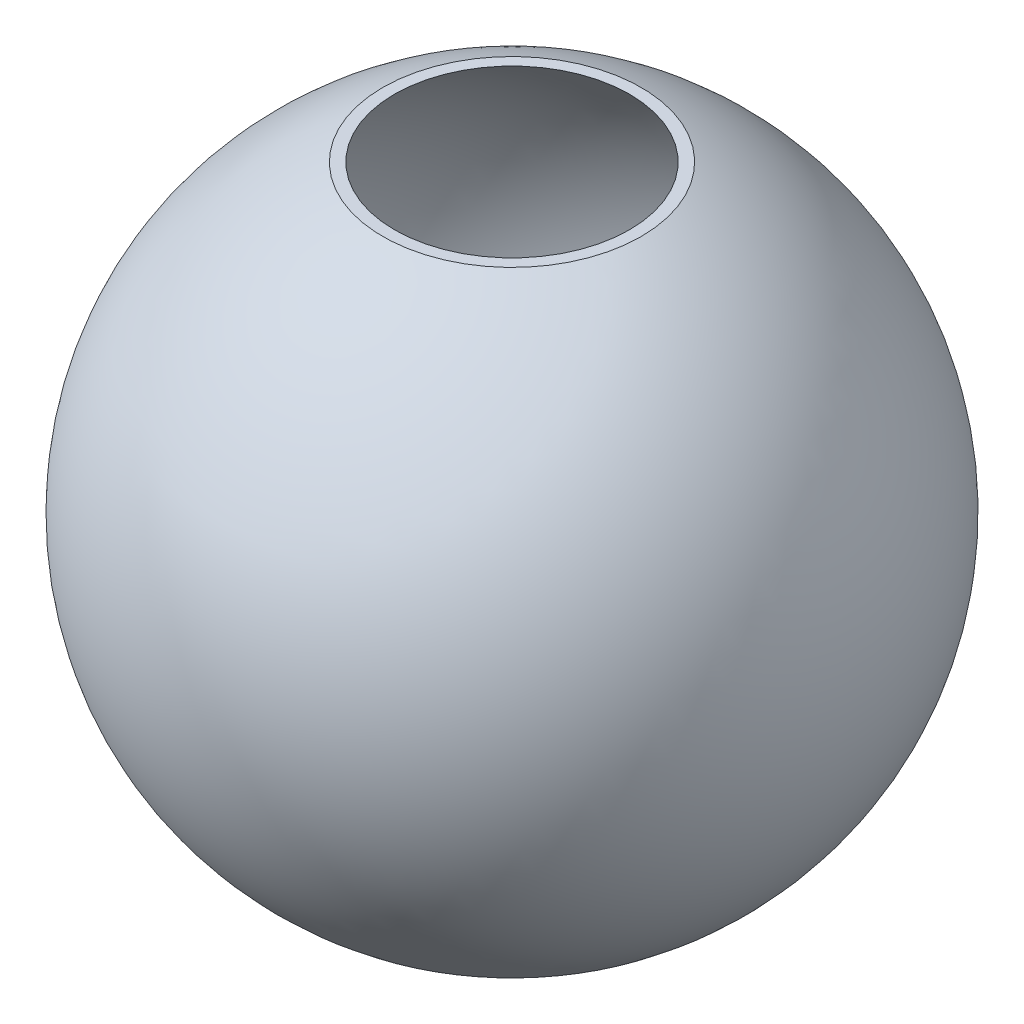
from build123d import *


with BuildPart() as part:
    # Szkic1 → Obr_t1 (revolve)
    with BuildSketch(Plane.XY):
        with BuildLine():
            Line((0, -75), (0, -74))
            ThreePointArc((0, -74), (72.739260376, -13.601470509), (26.739483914, 69))
            Line((26.739483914, 69), (29.393876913, 69))
            ThreePointArc((29.393876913, 69), (73.484692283, -15), (0, -75))
        make_face()
    revolve(axis=Axis((0, 69, 0), (0, -1, 0)))


solid = part.part
